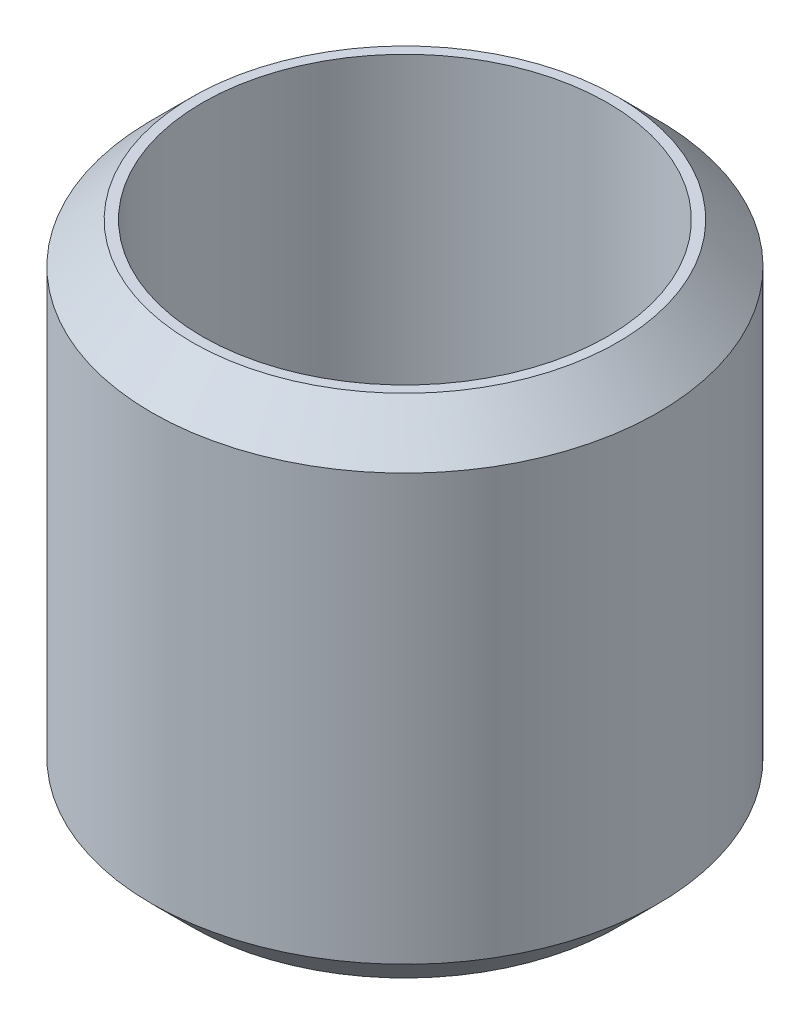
from build123d import *

# Parameters (mm, degrees)
SKETCH1_R           = 12.5
SKETCH1_R_2         = 10
BOSS_EXTRUDE1_DEPTH = 25
CHAMFER1_SIZE       = 2


with BuildPart() as part:
    # Sketch1 → Boss-Extrude1 (new body)
    with BuildSketch(Plane(origin=(0, 0, 0), x_dir=(1, 0, 0), z_dir=(0, 1, 0))):
        with Locations(Location((0, 0, 0), (0, 0, 270))):
            Circle(SKETCH1_R)
        with Locations(Location((0, 0, 0), (0, 0, 270))):
            Circle(SKETCH1_R_2, mode=Mode.SUBTRACT)
    extrude(amount=BOSS_EXTRUDE1_DEPTH)

    # Chamfer1
    chamfer1_edges = [part.edges().sort_by_distance(p)[0] for p in [
        (0, 0, -12.5),
        (0, 25, -12.5),
    ]]
    chamfer(chamfer1_edges, length=CHAMFER1_SIZE)


solid = part.part
